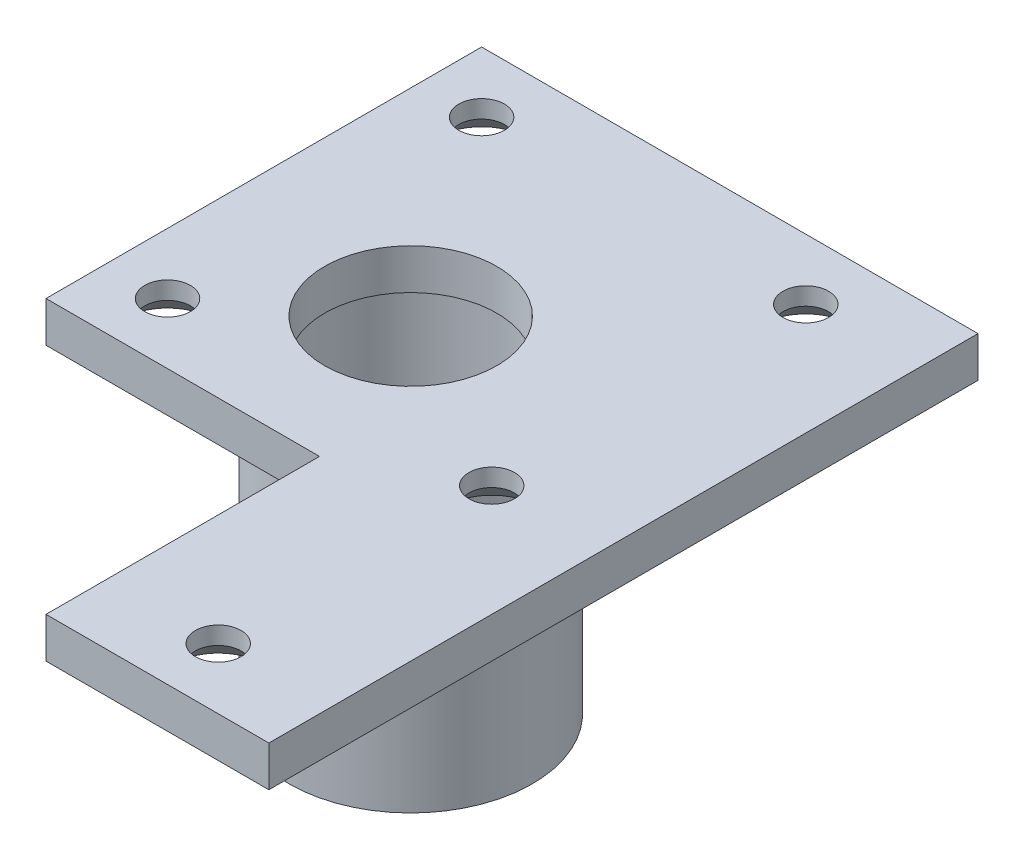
ISO-10303-21;
HEADER;
FILE_DESCRIPTION(('STEP AP214'),'2;1');
FILE_NAME('part.step','',(''),(''),'','','');
FILE_SCHEMA(('AUTOMOTIVE_DESIGN { 1 0 10303 214 1 1 1 1 }'));
ENDSEC;
DATA;
#1=APPLICATION_CONTEXT('core data for automotive mechanical design processes');
#2=APPLICATION_PROTOCOL_DEFINITION('international standard','automotive_design',2000,#1);
#3=PRODUCT_CONTEXT('',#1,'mechanical');
#4=PRODUCT('Part','Part','',(#3));
#5=PRODUCT_RELATED_PRODUCT_CATEGORY('part','',(#4));
#6=PRODUCT_DEFINITION_FORMATION('','',#4);
#7=PRODUCT_DEFINITION_CONTEXT('part definition',#1,'design');
#8=PRODUCT_DEFINITION('design','',#6,#7);
#9=PRODUCT_DEFINITION_SHAPE('','',#8);
#10=(LENGTH_UNIT() NAMED_UNIT(*) SI_UNIT(.MILLI.,.METRE.));
#11=(NAMED_UNIT(*) PLANE_ANGLE_UNIT() SI_UNIT($,.RADIAN.));
#12=(NAMED_UNIT(*) SI_UNIT($,.STERADIAN.) SOLID_ANGLE_UNIT());
#13=UNCERTAINTY_MEASURE_WITH_UNIT(LENGTH_MEASURE(1.E-05),#10,'distance_accuracy_value','');
#14=(GEOMETRIC_REPRESENTATION_CONTEXT(3) GLOBAL_UNCERTAINTY_ASSIGNED_CONTEXT((#13)) GLOBAL_UNIT_ASSIGNED_CONTEXT((#10,
#11,#12)) REPRESENTATION_CONTEXT('',''));
#15=CARTESIAN_POINT('',(0.,0.,0.));
#16=DIRECTION('',(0.,0.,1.));
#17=DIRECTION('',(1.,0.,0.));
#18=AXIS2_PLACEMENT_3D('',#15,#16,#17);
#19=CARTESIAN_POINT('',(0.,-30.,0.));
#20=DIRECTION('',(0.,1.,0.));
#21=DIRECTION('',(0.,0.,1.));
#22=AXIS2_PLACEMENT_3D('',#19,#20,#21);
#23=CYLINDRICAL_SURFACE('',#22,12.);
#24=CARTESIAN_POINT('',(0.,-0.5,0.));
#25=DIRECTION('',(0.,1.,0.));
#26=DIRECTION('',(0.,0.,1.));
#27=AXIS2_PLACEMENT_3D('',#24,#25,#26);
#28=CIRCLE('',#27,12.);
#29=CARTESIAN_POINT('',(0.,-0.5,12.));
#30=VERTEX_POINT('',#29);
#31=EDGE_CURVE('E112',#30,#30,#28,.T.);
#32=ORIENTED_EDGE('',*,*,#31,.F.);
#33=EDGE_LOOP('',(#32));
#34=FACE_BOUND('',#33,.T.);
#35=CARTESIAN_POINT('',(0.,-30.,0.));
#36=DIRECTION('',(0.,1.,0.));
#37=DIRECTION('',(0.,0.,1.));
#38=AXIS2_PLACEMENT_3D('',#35,#36,#37);
#39=CIRCLE('',#38,12.);
#40=CARTESIAN_POINT('',(0.,-30.,12.));
#41=VERTEX_POINT('',#40);
#42=EDGE_CURVE('E20',#41,#41,#39,.F.);
#43=ORIENTED_EDGE('',*,*,#42,.F.);
#44=EDGE_LOOP('',(#43));
#45=FACE_BOUND('',#44,.T.);
#46=ADVANCED_FACE('F17',(#34,#45),#23,.T.);
#47=CARTESIAN_POINT('',(0.,-30.,0.));
#48=DIRECTION('',(0.,-1.,0.));
#49=DIRECTION('',(0.,0.,-1.));
#50=AXIS2_PLACEMENT_3D('',#47,#48,#49);
#51=PLANE('',#50);
#52=ORIENTED_EDGE('',*,*,#42,.T.);
#53=EDGE_LOOP('',(#52));
#54=FACE_BOUND('',#53,.T.);
#55=CARTESIAN_POINT('',(0.,-30.,0.));
#56=DIRECTION('',(0.,-1.,0.));
#57=DIRECTION('',(0.,0.,-1.));
#58=AXIS2_PLACEMENT_3D('',#55,#56,#57);
#59=CIRCLE('',#58,9.9);
#60=CARTESIAN_POINT('',(0.,-30.,-9.9));
#61=VERTEX_POINT('',#60);
#62=EDGE_CURVE('E114',#61,#61,#59,.F.);
#63=ORIENTED_EDGE('',*,*,#62,.T.);
#64=EDGE_LOOP('',(#63));
#65=FACE_BOUND('',#64,.T.);
#66=ADVANCED_FACE('F157',(#54,#65),#51,.T.);
#67=CARTESIAN_POINT('',(0.,0.,0.));
#68=DIRECTION('',(0.,1.,0.));
#69=DIRECTION('',(0.,0.,1.));
#70=AXIS2_PLACEMENT_3D('',#67,#68,#69);
#71=CONICAL_SURFACE('',#70,12.5,0.785398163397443);
#72=CARTESIAN_POINT('',(0.,0.,0.));
#73=DIRECTION('',(0.,1.,0.));
#74=DIRECTION('',(0.,0.,1.));
#75=AXIS2_PLACEMENT_3D('',#72,#73,#74);
#76=CIRCLE('',#75,12.5);
#77=CARTESIAN_POINT('',(0.,0.,12.5));
#78=VERTEX_POINT('',#77);
#79=EDGE_CURVE('E152',#78,#78,#76,.F.);
#80=ORIENTED_EDGE('',*,*,#79,.T.);
#81=EDGE_LOOP('',(#80));
#82=FACE_BOUND('',#81,.T.);
#83=ORIENTED_EDGE('',*,*,#31,.T.);
#84=EDGE_LOOP('',(#83));
#85=FACE_BOUND('',#84,.T.);
#86=ADVANCED_FACE('F163',(#82,#85),#71,.T.);
#87=CARTESIAN_POINT('',(0.,0.,0.));
#88=DIRECTION('',(0.,-1.,0.));
#89=DIRECTION('',(0.,0.,-1.));
#90=AXIS2_PLACEMENT_3D('',#87,#88,#89);
#91=CYLINDRICAL_SURFACE('',#90,9.9);
#92=ORIENTED_EDGE('',*,*,#62,.F.);
#93=EDGE_LOOP('',(#92));
#94=FACE_BOUND('',#93,.T.);
#95=CARTESIAN_POINT('',(0.,0.,0.));
#96=DIRECTION('',(0.,-1.,0.));
#97=DIRECTION('',(0.,0.,-1.));
#98=AXIS2_PLACEMENT_3D('',#95,#96,#97);
#99=CIRCLE('',#98,9.9);
#100=CARTESIAN_POINT('',(0.,0.,-9.9));
#101=VERTEX_POINT('',#100);
#102=EDGE_CURVE('E111',#101,#101,#99,.T.);
#103=ORIENTED_EDGE('',*,*,#102,.F.);
#104=EDGE_LOOP('',(#103));
#105=FACE_BOUND('',#104,.T.);
#106=ADVANCED_FACE('F159',(#94,#105),#91,.F.);
#107=CARTESIAN_POINT('',(-13.5,5.6843418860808E-11,10.5));
#108=DIRECTION('',(0.,-1.,0.));
#109=DIRECTION('',(0.,0.,-1.));
#110=AXIS2_PLACEMENT_3D('',#107,#108,#109);
#111=CONICAL_SURFACE('',#110,4.49999999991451,0.785398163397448);
#112=CARTESIAN_POINT('',(-13.5,2.25,10.5));
#113=DIRECTION('',(0.,-1.,0.));
#114=DIRECTION('',(0.,0.,-1.));
#115=AXIS2_PLACEMENT_3D('',#112,#113,#114);
#116=CIRCLE('',#115,2.25);
#117=CARTESIAN_POINT('',(-13.5,2.25,8.25000000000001));
#118=VERTEX_POINT('',#117);
#119=EDGE_CURVE('E108',#118,#118,#116,.F.);
#120=ORIENTED_EDGE('',*,*,#119,.T.);
#121=EDGE_LOOP('',(#120));
#122=FACE_BOUND('',#121,.T.);
#123=CARTESIAN_POINT('',(-13.5,0.,10.5));
#124=DIRECTION('',(0.,-1.,0.));
#125=DIRECTION('',(0.,0.,-1.));
#126=AXIS2_PLACEMENT_3D('',#123,#124,#125);
#127=CIRCLE('',#126,4.49999999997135);
#128=CARTESIAN_POINT('',(-13.5,0.,6.00000000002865));
#129=VERTEX_POINT('',#128);
#130=EDGE_CURVE('E149',#129,#129,#127,.T.);
#131=ORIENTED_EDGE('',*,*,#130,.T.);
#132=EDGE_LOOP('',(#131));
#133=FACE_BOUND('',#132,.T.);
#134=ADVANCED_FACE('F162',(#122,#133),#111,.F.);
#135=CARTESIAN_POINT('',(18.5,5.6843418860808E-11,10.5));
#136=DIRECTION('',(0.,-1.,0.));
#137=DIRECTION('',(0.,0.,-1.));
#138=AXIS2_PLACEMENT_3D('',#135,#136,#137);
#139=CONICAL_SURFACE('',#138,4.49999999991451,0.785398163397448);
#140=CARTESIAN_POINT('',(18.5,2.25,10.5));
#141=DIRECTION('',(0.,-1.,0.));
#142=DIRECTION('',(0.,0.,-1.));
#143=AXIS2_PLACEMENT_3D('',#140,#141,#142);
#144=CIRCLE('',#143,2.24999999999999);
#145=CARTESIAN_POINT('',(18.5,2.25,8.25000000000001));
#146=VERTEX_POINT('',#145);
#147=EDGE_CURVE('E105',#146,#146,#144,.F.);
#148=ORIENTED_EDGE('',*,*,#147,.T.);
#149=EDGE_LOOP('',(#148));
#150=FACE_BOUND('',#149,.T.);
#151=CARTESIAN_POINT('',(18.5,0.,10.5));
#152=DIRECTION('',(0.,-1.,0.));
#153=DIRECTION('',(0.,0.,-1.));
#154=AXIS2_PLACEMENT_3D('',#151,#152,#153);
#155=CIRCLE('',#154,4.49999999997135);
#156=CARTESIAN_POINT('',(18.5,0.,6.00000000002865));
#157=VERTEX_POINT('',#156);
#158=EDGE_CURVE('E146',#157,#157,#155,.T.);
#159=ORIENTED_EDGE('',*,*,#158,.T.);
#160=EDGE_LOOP('',(#159));
#161=FACE_BOUND('',#160,.T.);
#162=ADVANCED_FACE('F233',(#150,#161),#139,.F.);
#163=CARTESIAN_POINT('',(18.5,-5.6843418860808E-11,-20.5));
#164=DIRECTION('',(0.,-1.,0.));
#165=DIRECTION('',(0.,0.,-1.));
#166=AXIS2_PLACEMENT_3D('',#163,#164,#165);
#167=CONICAL_SURFACE('',#166,4.5000000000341,0.78539816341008);
#168=CARTESIAN_POINT('',(18.5,2.25,-20.5));
#169=DIRECTION('',(0.,-1.,0.));
#170=DIRECTION('',(0.,0.,-1.));
#171=AXIS2_PLACEMENT_3D('',#168,#169,#170);
#172=CIRCLE('',#171,2.25);
#173=CARTESIAN_POINT('',(18.5,2.25,-22.75));
#174=VERTEX_POINT('',#173);
#175=EDGE_CURVE('E102',#174,#174,#172,.F.);
#176=ORIENTED_EDGE('',*,*,#175,.T.);
#177=EDGE_LOOP('',(#176));
#178=FACE_BOUND('',#177,.T.);
#179=CARTESIAN_POINT('',(18.5,2.68257638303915E-11,-20.5));
#180=DIRECTION('',(0.,-1.,0.));
#181=DIRECTION('',(0.,0.,-1.));
#182=AXIS2_PLACEMENT_3D('',#179,#180,#181);
#183=CIRCLE('',#182,4.49999999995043);
#184=CARTESIAN_POINT('',(18.5,2.68257638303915E-11,-24.9999999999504));
#185=VERTEX_POINT('',#184);
#186=EDGE_CURVE('E143',#185,#185,#183,.T.);
#187=ORIENTED_EDGE('',*,*,#186,.T.);
#188=EDGE_LOOP('',(#187));
#189=FACE_BOUND('',#188,.T.);
#190=ADVANCED_FACE('F236',(#178,#189),#167,.F.);
#191=CARTESIAN_POINT('',(-13.5,-5.6843418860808E-11,-20.5));
#192=DIRECTION('',(0.,-1.,0.));
#193=DIRECTION('',(0.,0.,-1.));
#194=AXIS2_PLACEMENT_3D('',#191,#192,#193);
#195=CONICAL_SURFACE('',#194,4.5000000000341,0.78539816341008);
#196=CARTESIAN_POINT('',(-13.5,2.25,-20.5));
#197=DIRECTION('',(0.,-1.,0.));
#198=DIRECTION('',(0.,0.,-1.));
#199=AXIS2_PLACEMENT_3D('',#196,#197,#198);
#200=CIRCLE('',#199,2.25);
#201=CARTESIAN_POINT('',(-13.5,2.25,-22.75));
#202=VERTEX_POINT('',#201);
#203=EDGE_CURVE('E99',#202,#202,#200,.F.);
#204=ORIENTED_EDGE('',*,*,#203,.T.);
#205=EDGE_LOOP('',(#204));
#206=FACE_BOUND('',#205,.T.);
#207=CARTESIAN_POINT('',(-13.5,2.68257638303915E-11,-20.5));
#208=DIRECTION('',(0.,-1.,0.));
#209=DIRECTION('',(0.,0.,-1.));
#210=AXIS2_PLACEMENT_3D('',#207,#208,#209);
#211=CIRCLE('',#210,4.49999999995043);
#212=CARTESIAN_POINT('',(-13.5,2.68257638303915E-11,-24.9999999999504));
#213=VERTEX_POINT('',#212);
#214=EDGE_CURVE('E140',#213,#213,#211,.T.);
#215=ORIENTED_EDGE('',*,*,#214,.T.);
#216=EDGE_LOOP('',(#215));
#217=FACE_BOUND('',#216,.T.);
#218=ADVANCED_FACE('F264',(#206,#217),#195,.F.);
#219=CARTESIAN_POINT('',(18.5,5.6843418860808E-11,37.5));
#220=DIRECTION('',(0.,-1.,0.));
#221=DIRECTION('',(0.,0.,-1.));
#222=AXIS2_PLACEMENT_3D('',#219,#220,#221);
#223=CONICAL_SURFACE('',#222,4.49999999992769,0.785398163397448);
#224=CARTESIAN_POINT('',(18.5,2.25,37.5));
#225=DIRECTION('',(0.,-1.,0.));
#226=DIRECTION('',(0.,0.,-1.));
#227=AXIS2_PLACEMENT_3D('',#224,#225,#226);
#228=CIRCLE('',#227,2.25);
#229=CARTESIAN_POINT('',(18.5,2.25,35.25));
#230=VERTEX_POINT('',#229);
#231=EDGE_CURVE('E81',#230,#230,#228,.F.);
#232=ORIENTED_EDGE('',*,*,#231,.T.);
#233=EDGE_LOOP('',(#232));
#234=FACE_BOUND('',#233,.T.);
#235=CARTESIAN_POINT('',(18.5,0.,37.5));
#236=DIRECTION('',(0.,-1.,0.));
#237=DIRECTION('',(0.,0.,-1.));
#238=AXIS2_PLACEMENT_3D('',#235,#236,#237);
#239=CIRCLE('',#238,4.49999999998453);
#240=CARTESIAN_POINT('',(18.5,0.,33.0000000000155));
#241=VERTEX_POINT('',#240);
#242=EDGE_CURVE('E137',#241,#241,#239,.T.);
#243=ORIENTED_EDGE('',*,*,#242,.T.);
#244=EDGE_LOOP('',(#243));
#245=FACE_BOUND('',#244,.T.);
#246=ADVANCED_FACE('F180',(#234,#245),#223,.F.);
#247=CARTESIAN_POINT('',(0.,0.,0.));
#248=DIRECTION('',(0.,1.,0.));
#249=DIRECTION('',(0.,0.,1.));
#250=AXIS2_PLACEMENT_3D('',#247,#248,#249);
#251=PLANE('',#250);
#252=DIRECTION('',(0.,0.,-1.));
#253=VECTOR('',#252,1.);
#254=CARTESIAN_POINT('',(29.5,0.,0.));
#255=LINE('',#254,#253);
#256=CARTESIAN_POINT('',(29.5,0.,43.5));
#257=VERTEX_POINT('',#256);
#258=CARTESIAN_POINT('',(29.5,0.,-26.5));
#259=VERTEX_POINT('',#258);
#260=EDGE_CURVE('E68',#257,#259,#255,.T.);
#261=ORIENTED_EDGE('',*,*,#260,.F.);
#262=DIRECTION('',(-1.,0.,0.));
#263=VECTOR('',#262,1.);
#264=CARTESIAN_POINT('',(0.,0.,43.5));
#265=LINE('',#264,#263);
#266=CARTESIAN_POINT('',(7.5,0.,43.5));
#267=VERTEX_POINT('',#266);
#268=EDGE_CURVE('E73',#257,#267,#265,.T.);
#269=ORIENTED_EDGE('',*,*,#268,.T.);
#270=DIRECTION('',(0.,0.,-1.));
#271=VECTOR('',#270,1.);
#272=CARTESIAN_POINT('',(7.5,0.,43.5));
#273=LINE('',#272,#271);
#274=CARTESIAN_POINT('',(7.5,0.,16.5));
#275=VERTEX_POINT('',#274);
#276=EDGE_CURVE('E459',#267,#275,#273,.T.);
#277=ORIENTED_EDGE('',*,*,#276,.T.);
#278=DIRECTION('',(-1.,0.,0.));
#279=VECTOR('',#278,1.);
#280=CARTESIAN_POINT('',(-19.5,0.,16.5));
#281=LINE('',#280,#279);
#282=CARTESIAN_POINT('',(-19.5,0.,16.5));
#283=VERTEX_POINT('',#282);
#284=EDGE_CURVE('E447',#275,#283,#281,.T.);
#285=ORIENTED_EDGE('',*,*,#284,.T.);
#286=DIRECTION('',(0.,0.,-1.));
#287=VECTOR('',#286,1.);
#288=CARTESIAN_POINT('',(-19.5,0.,-16.5));
#289=LINE('',#288,#287);
#290=CARTESIAN_POINT('',(-19.5,0.,-26.5));
#291=VERTEX_POINT('',#290);
#292=EDGE_CURVE('E446',#283,#291,#289,.T.);
#293=ORIENTED_EDGE('',*,*,#292,.T.);
#294=DIRECTION('',(-1.,0.,0.));
#295=VECTOR('',#294,1.);
#296=CARTESIAN_POINT('',(0.,0.,-26.5));
#297=LINE('',#296,#295);
#298=EDGE_CURVE('E86',#259,#291,#297,.T.);
#299=ORIENTED_EDGE('',*,*,#298,.F.);
#300=EDGE_LOOP('',(#261,#269,#277,#285,#293,#299));
#301=FACE_BOUND('',#300,.T.);
#302=ORIENTED_EDGE('',*,*,#242,.F.);
#303=EDGE_LOOP('',(#302));
#304=FACE_BOUND('',#303,.T.);
#305=ORIENTED_EDGE('',*,*,#214,.F.);
#306=EDGE_LOOP('',(#305));
#307=FACE_BOUND('',#306,.T.);
#308=ORIENTED_EDGE('',*,*,#186,.F.);
#309=EDGE_LOOP('',(#308));
#310=FACE_BOUND('',#309,.T.);
#311=ORIENTED_EDGE('',*,*,#158,.F.);
#312=EDGE_LOOP('',(#311));
#313=FACE_BOUND('',#312,.T.);
#314=ORIENTED_EDGE('',*,*,#130,.F.);
#315=EDGE_LOOP('',(#314));
#316=FACE_BOUND('',#315,.T.);
#317=ORIENTED_EDGE('',*,*,#79,.F.);
#318=EDGE_LOOP('',(#317));
#319=FACE_BOUND('',#318,.T.);
#320=ADVANCED_FACE('F83',(#301,#304,#307,#310,#313,#316,#319),#251,.F.);
#321=CARTESIAN_POINT('',(0.,0.,0.));
#322=DIRECTION('',(0.,-1.,0.));
#323=DIRECTION('',(0.,0.,-1.));
#324=AXIS2_PLACEMENT_3D('',#321,#322,#323);
#325=PLANE('',#324);
#326=CARTESIAN_POINT('',(0.,0.,0.));
#327=DIRECTION('',(0.,1.,0.));
#328=DIRECTION('',(0.,0.,1.));
#329=AXIS2_PLACEMENT_3D('',#326,#327,#328);
#330=CIRCLE('',#329,8.5);
#331=CARTESIAN_POINT('',(0.,0.,8.5));
#332=VERTEX_POINT('',#331);
#333=EDGE_CURVE('E132',#332,#332,#330,.T.);
#334=ORIENTED_EDGE('',*,*,#333,.T.);
#335=EDGE_LOOP('',(#334));
#336=FACE_BOUND('',#335,.T.);
#337=ORIENTED_EDGE('',*,*,#102,.T.);
#338=EDGE_LOOP('',(#337));
#339=FACE_BOUND('',#338,.T.);
#340=ADVANCED_FACE('F167',(#336,#339),#325,.T.);
#341=CARTESIAN_POINT('',(-13.5,0.,10.5));
#342=DIRECTION('',(0.,-1.,0.));
#343=DIRECTION('',(0.,0.,-1.));
#344=AXIS2_PLACEMENT_3D('',#341,#342,#343);
#345=CYLINDRICAL_SURFACE('',#344,2.25);
#346=CARTESIAN_POINT('',(-13.5,4.,10.5));
#347=DIRECTION('',(0.,-1.,0.));
#348=DIRECTION('',(0.,0.,-1.));
#349=AXIS2_PLACEMENT_3D('',#346,#347,#348);
#350=CIRCLE('',#349,2.25);
#351=CARTESIAN_POINT('',(-13.5,4.,8.25000000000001));
#352=VERTEX_POINT('',#351);
#353=EDGE_CURVE('E129',#352,#352,#350,.T.);
#354=ORIENTED_EDGE('',*,*,#353,.F.);
#355=EDGE_LOOP('',(#354));
#356=FACE_BOUND('',#355,.T.);
#357=ORIENTED_EDGE('',*,*,#119,.F.);
#358=EDGE_LOOP('',(#357));
#359=FACE_BOUND('',#358,.T.);
#360=ADVANCED_FACE('F169',(#356,#359),#345,.F.);
#361=CARTESIAN_POINT('',(18.5,0.,10.5));
#362=DIRECTION('',(0.,-1.,0.));
#363=DIRECTION('',(0.,0.,-1.));
#364=AXIS2_PLACEMENT_3D('',#361,#362,#363);
#365=CYLINDRICAL_SURFACE('',#364,2.24999999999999);
#366=CARTESIAN_POINT('',(18.5,4.,10.5));
#367=DIRECTION('',(0.,-1.,0.));
#368=DIRECTION('',(0.,0.,-1.));
#369=AXIS2_PLACEMENT_3D('',#366,#367,#368);
#370=CIRCLE('',#369,2.24999999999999);
#371=CARTESIAN_POINT('',(18.5,4.,8.25000000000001));
#372=VERTEX_POINT('',#371);
#373=EDGE_CURVE('E126',#372,#372,#370,.T.);
#374=ORIENTED_EDGE('',*,*,#373,.F.);
#375=EDGE_LOOP('',(#374));
#376=FACE_BOUND('',#375,.T.);
#377=ORIENTED_EDGE('',*,*,#147,.F.);
#378=EDGE_LOOP('',(#377));
#379=FACE_BOUND('',#378,.T.);
#380=ADVANCED_FACE('F177',(#376,#379),#365,.F.);
#381=CARTESIAN_POINT('',(18.5,0.,-20.5));
#382=DIRECTION('',(0.,-1.,0.));
#383=DIRECTION('',(0.,0.,-1.));
#384=AXIS2_PLACEMENT_3D('',#381,#382,#383);
#385=CYLINDRICAL_SURFACE('',#384,2.25);
#386=CARTESIAN_POINT('',(18.5,4.,-20.5));
#387=DIRECTION('',(0.,-1.,0.));
#388=DIRECTION('',(0.,0.,-1.));
#389=AXIS2_PLACEMENT_3D('',#386,#387,#388);
#390=CIRCLE('',#389,2.25);
#391=CARTESIAN_POINT('',(18.5,4.,-22.75));
#392=VERTEX_POINT('',#391);
#393=EDGE_CURVE('E123',#392,#392,#390,.T.);
#394=ORIENTED_EDGE('',*,*,#393,.F.);
#395=EDGE_LOOP('',(#394));
#396=FACE_BOUND('',#395,.T.);
#397=ORIENTED_EDGE('',*,*,#175,.F.);
#398=EDGE_LOOP('',(#397));
#399=FACE_BOUND('',#398,.T.);
#400=ADVANCED_FACE('F220',(#396,#399),#385,.F.);
#401=CARTESIAN_POINT('',(-13.5,0.,-20.5));
#402=DIRECTION('',(0.,-1.,0.));
#403=DIRECTION('',(0.,0.,-1.));
#404=AXIS2_PLACEMENT_3D('',#401,#402,#403);
#405=CYLINDRICAL_SURFACE('',#404,2.25);
#406=CARTESIAN_POINT('',(-13.5,4.,-20.5));
#407=DIRECTION('',(0.,-1.,0.));
#408=DIRECTION('',(0.,0.,-1.));
#409=AXIS2_PLACEMENT_3D('',#406,#407,#408);
#410=CIRCLE('',#409,2.25);
#411=CARTESIAN_POINT('',(-13.5,4.,-22.75));
#412=VERTEX_POINT('',#411);
#413=EDGE_CURVE('E120',#412,#412,#410,.T.);
#414=ORIENTED_EDGE('',*,*,#413,.F.);
#415=EDGE_LOOP('',(#414));
#416=FACE_BOUND('',#415,.T.);
#417=ORIENTED_EDGE('',*,*,#203,.F.);
#418=EDGE_LOOP('',(#417));
#419=FACE_BOUND('',#418,.T.);
#420=ADVANCED_FACE('F216',(#416,#419),#405,.F.);
#421=CARTESIAN_POINT('',(18.5,0.,37.5));
#422=DIRECTION('',(0.,-1.,0.));
#423=DIRECTION('',(0.,0.,-1.));
#424=AXIS2_PLACEMENT_3D('',#421,#422,#423);
#425=CYLINDRICAL_SURFACE('',#424,2.25);
#426=CARTESIAN_POINT('',(18.5,4.,37.5));
#427=DIRECTION('',(0.,-1.,0.));
#428=DIRECTION('',(0.,0.,-1.));
#429=AXIS2_PLACEMENT_3D('',#426,#427,#428);
#430=CIRCLE('',#429,2.25);
#431=CARTESIAN_POINT('',(18.5,4.,35.25));
#432=VERTEX_POINT('',#431);
#433=EDGE_CURVE('E116',#432,#432,#430,.T.);
#434=ORIENTED_EDGE('',*,*,#433,.F.);
#435=EDGE_LOOP('',(#434));
#436=FACE_BOUND('',#435,.T.);
#437=ORIENTED_EDGE('',*,*,#231,.F.);
#438=EDGE_LOOP('',(#437));
#439=FACE_BOUND('',#438,.T.);
#440=ADVANCED_FACE('F213',(#436,#439),#425,.F.);
#441=CARTESIAN_POINT('',(0.,0.,43.5));
#442=DIRECTION('',(0.,0.,-1.));
#443=DIRECTION('',(-1.,0.,0.));
#444=AXIS2_PLACEMENT_3D('',#441,#442,#443);
#445=PLANE('',#444);
#446=DIRECTION('',(0.,1.,0.));
#447=VECTOR('',#446,1.);
#448=CARTESIAN_POINT('',(29.5,0.,43.5));
#449=LINE('',#448,#447);
#450=CARTESIAN_POINT('',(29.5,4.,43.5));
#451=VERTEX_POINT('',#450);
#452=EDGE_CURVE('E75',#451,#257,#449,.F.);
#453=ORIENTED_EDGE('',*,*,#452,.F.);
#454=DIRECTION('',(1.,0.,0.));
#455=VECTOR('',#454,1.);
#456=CARTESIAN_POINT('',(0.,4.,43.5));
#457=LINE('',#456,#455);
#458=CARTESIAN_POINT('',(7.5,4.,43.5));
#459=VERTEX_POINT('',#458);
#460=EDGE_CURVE('E119',#459,#451,#457,.T.);
#461=ORIENTED_EDGE('',*,*,#460,.F.);
#462=DIRECTION('',(0.,1.,0.));
#463=VECTOR('',#462,1.);
#464=CARTESIAN_POINT('',(7.5,4.,43.5));
#465=LINE('',#464,#463);
#466=EDGE_CURVE('E78',#459,#267,#465,.F.);
#467=ORIENTED_EDGE('',*,*,#466,.T.);
#468=ORIENTED_EDGE('',*,*,#268,.F.);
#469=EDGE_LOOP('',(#453,#461,#467,#468));
#470=FACE_BOUND('',#469,.T.);
#471=ADVANCED_FACE('F74',(#470),#445,.F.);
#472=CARTESIAN_POINT('',(29.5,0.,0.));
#473=DIRECTION('',(1.,0.,0.));
#474=DIRECTION('',(0.,0.,-1.));
#475=AXIS2_PLACEMENT_3D('',#472,#473,#474);
#476=PLANE('',#475);
#477=DIRECTION('',(0.,1.,0.));
#478=VECTOR('',#477,1.);
#479=CARTESIAN_POINT('',(29.5,0.,-26.5));
#480=LINE('',#479,#478);
#481=CARTESIAN_POINT('',(29.5,4.,-26.5));
#482=VERTEX_POINT('',#481);
#483=EDGE_CURVE('E88',#482,#259,#480,.F.);
#484=ORIENTED_EDGE('',*,*,#483,.F.);
#485=DIRECTION('',(0.,0.,1.));
#486=VECTOR('',#485,1.);
#487=CARTESIAN_POINT('',(29.5,4.,0.));
#488=LINE('',#487,#486);
#489=EDGE_CURVE('E92',#451,#482,#488,.F.);
#490=ORIENTED_EDGE('',*,*,#489,.F.);
#491=ORIENTED_EDGE('',*,*,#452,.T.);
#492=ORIENTED_EDGE('',*,*,#260,.T.);
#493=EDGE_LOOP('',(#484,#490,#491,#492));
#494=FACE_BOUND('',#493,.T.);
#495=ADVANCED_FACE('F90',(#494),#476,.T.);
#496=CARTESIAN_POINT('',(0.,0.,-26.5));
#497=DIRECTION('',(0.,0.,-1.));
#498=DIRECTION('',(-1.,0.,0.));
#499=AXIS2_PLACEMENT_3D('',#496,#497,#498);
#500=PLANE('',#499);
#501=ORIENTED_EDGE('',*,*,#298,.T.);
#502=DIRECTION('',(0.,1.,0.));
#503=VECTOR('',#502,1.);
#504=CARTESIAN_POINT('',(-19.5,4.,-26.5));
#505=LINE('',#504,#503);
#506=CARTESIAN_POINT('',(-19.5,4.,-26.5));
#507=VERTEX_POINT('',#506);
#508=EDGE_CURVE('E442',#291,#507,#505,.T.);
#509=ORIENTED_EDGE('',*,*,#508,.T.);
#510=DIRECTION('',(1.,0.,0.));
#511=VECTOR('',#510,1.);
#512=CARTESIAN_POINT('',(0.,4.,-26.5));
#513=LINE('',#512,#511);
#514=EDGE_CURVE('E464',#482,#507,#513,.F.);
#515=ORIENTED_EDGE('',*,*,#514,.F.);
#516=ORIENTED_EDGE('',*,*,#483,.T.);
#517=EDGE_LOOP('',(#501,#509,#515,#516));
#518=FACE_BOUND('',#517,.T.);
#519=ADVANCED_FACE('F204',(#518),#500,.T.);
#520=CARTESIAN_POINT('',(-19.5,4.,-16.5));
#521=DIRECTION('',(1.,0.,0.));
#522=DIRECTION('',(0.,0.,-1.));
#523=AXIS2_PLACEMENT_3D('',#520,#521,#522);
#524=PLANE('',#523);
#525=DIRECTION('',(0.,1.,0.));
#526=VECTOR('',#525,1.);
#527=CARTESIAN_POINT('',(-19.5,4.,16.5));
#528=LINE('',#527,#526);
#529=CARTESIAN_POINT('',(-19.5,4.,16.5));
#530=VERTEX_POINT('',#529);
#531=EDGE_CURVE('E456',#283,#530,#528,.T.);
#532=ORIENTED_EDGE('',*,*,#531,.T.);
#533=DIRECTION('',(0.,0.,1.));
#534=VECTOR('',#533,1.);
#535=CARTESIAN_POINT('',(-19.5,4.,0.));
#536=LINE('',#535,#534);
#537=EDGE_CURVE('E451',#507,#530,#536,.T.);
#538=ORIENTED_EDGE('',*,*,#537,.F.);
#539=ORIENTED_EDGE('',*,*,#508,.F.);
#540=ORIENTED_EDGE('',*,*,#292,.F.);
#541=EDGE_LOOP('',(#532,#538,#539,#540));
#542=FACE_BOUND('',#541,.T.);
#543=ADVANCED_FACE('F201',(#542),#524,.F.);
#544=CARTESIAN_POINT('',(-19.5,4.,16.5));
#545=DIRECTION('',(0.,0.,-1.));
#546=DIRECTION('',(-1.,0.,0.));
#547=AXIS2_PLACEMENT_3D('',#544,#545,#546);
#548=PLANE('',#547);
#549=DIRECTION('',(1.,0.,0.));
#550=VECTOR('',#549,1.);
#551=CARTESIAN_POINT('',(0.,4.,16.5));
#552=LINE('',#551,#550);
#553=CARTESIAN_POINT('',(7.5,4.,16.5));
#554=VERTEX_POINT('',#553);
#555=EDGE_CURVE('E467',#530,#554,#552,.T.);
#556=ORIENTED_EDGE('',*,*,#555,.F.);
#557=ORIENTED_EDGE('',*,*,#531,.F.);
#558=ORIENTED_EDGE('',*,*,#284,.F.);
#559=DIRECTION('',(0.,1.,0.));
#560=VECTOR('',#559,1.);
#561=CARTESIAN_POINT('',(7.5,4.,16.5));
#562=LINE('',#561,#560);
#563=EDGE_CURVE('E35',#275,#554,#562,.T.);
#564=ORIENTED_EDGE('',*,*,#563,.T.);
#565=EDGE_LOOP('',(#556,#557,#558,#564));
#566=FACE_BOUND('',#565,.T.);
#567=ADVANCED_FACE('F197',(#566),#548,.F.);
#568=CARTESIAN_POINT('',(7.5,4.,43.5));
#569=DIRECTION('',(1.,0.,0.));
#570=DIRECTION('',(0.,0.,-1.));
#571=AXIS2_PLACEMENT_3D('',#568,#569,#570);
#572=PLANE('',#571);
#573=ORIENTED_EDGE('',*,*,#276,.F.);
#574=ORIENTED_EDGE('',*,*,#466,.F.);
#575=DIRECTION('',(0.,0.,1.));
#576=VECTOR('',#575,1.);
#577=CARTESIAN_POINT('',(7.5,4.,0.));
#578=LINE('',#577,#576);
#579=EDGE_CURVE('E26',#554,#459,#578,.T.);
#580=ORIENTED_EDGE('',*,*,#579,.F.);
#581=ORIENTED_EDGE('',*,*,#563,.F.);
#582=EDGE_LOOP('',(#573,#574,#580,#581));
#583=FACE_BOUND('',#582,.T.);
#584=ADVANCED_FACE('F190',(#583),#572,.F.);
#585=CARTESIAN_POINT('',(0.,-4.99999999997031E-05,0.));
#586=DIRECTION('',(0.,1.,0.));
#587=DIRECTION('',(0.,0.,1.));
#588=AXIS2_PLACEMENT_3D('',#585,#586,#587);
#589=CYLINDRICAL_SURFACE('',#588,8.5);
#590=CARTESIAN_POINT('',(0.,4.,0.));
#591=DIRECTION('',(0.,1.,0.));
#592=DIRECTION('',(0.,0.,1.));
#593=AXIS2_PLACEMENT_3D('',#590,#591,#592);
#594=CIRCLE('',#593,8.5);
#595=CARTESIAN_POINT('',(0.,4.,8.5));
#596=VERTEX_POINT('',#595);
#597=EDGE_CURVE('E11',#596,#596,#594,.F.);
#598=ORIENTED_EDGE('',*,*,#597,.F.);
#599=EDGE_LOOP('',(#598));
#600=FACE_BOUND('',#599,.T.);
#601=ORIENTED_EDGE('',*,*,#333,.F.);
#602=EDGE_LOOP('',(#601));
#603=FACE_BOUND('',#602,.T.);
#604=ADVANCED_FACE('F184',(#600,#603),#589,.F.);
#605=CARTESIAN_POINT('',(0.,4.,0.));
#606=DIRECTION('',(0.,1.,0.));
#607=DIRECTION('',(0.,0.,1.));
#608=AXIS2_PLACEMENT_3D('',#605,#606,#607);
#609=PLANE('',#608);
#610=ORIENTED_EDGE('',*,*,#597,.T.);
#611=EDGE_LOOP('',(#610));
#612=FACE_BOUND('',#611,.T.);
#613=ORIENTED_EDGE('',*,*,#555,.T.);
#614=ORIENTED_EDGE('',*,*,#579,.T.);
#615=ORIENTED_EDGE('',*,*,#460,.T.);
#616=ORIENTED_EDGE('',*,*,#489,.T.);
#617=ORIENTED_EDGE('',*,*,#514,.T.);
#618=ORIENTED_EDGE('',*,*,#537,.T.);
#619=EDGE_LOOP('',(#613,#614,#615,#616,#617,#618));
#620=FACE_BOUND('',#619,.T.);
#621=ORIENTED_EDGE('',*,*,#433,.T.);
#622=EDGE_LOOP('',(#621));
#623=FACE_BOUND('',#622,.T.);
#624=ORIENTED_EDGE('',*,*,#413,.T.);
#625=EDGE_LOOP('',(#624));
#626=FACE_BOUND('',#625,.T.);
#627=ORIENTED_EDGE('',*,*,#393,.T.);
#628=EDGE_LOOP('',(#627));
#629=FACE_BOUND('',#628,.T.);
#630=ORIENTED_EDGE('',*,*,#373,.T.);
#631=EDGE_LOOP('',(#630));
#632=FACE_BOUND('',#631,.T.);
#633=ORIENTED_EDGE('',*,*,#353,.T.);
#634=EDGE_LOOP('',(#633));
#635=FACE_BOUND('',#634,.T.);
#636=ADVANCED_FACE('F182',(#612,#620,#623,#626,#629,#632,#635),#609,.T.);
#637=CLOSED_SHELL('',(#46,#66,#86,#106,#134,#162,#190,#218,#246,#320,#340,#360,#380,#400,#420,
#440,#471,#495,#519,#543,#567,#584,#604,#636));
#638=MANIFOLD_SOLID_BREP('B1',#637);
#639=ADVANCED_BREP_SHAPE_REPRESENTATION('',(#18,#638),#14);
#640=SHAPE_DEFINITION_REPRESENTATION(#9,#639);
ENDSEC;
END-ISO-10303-21;
